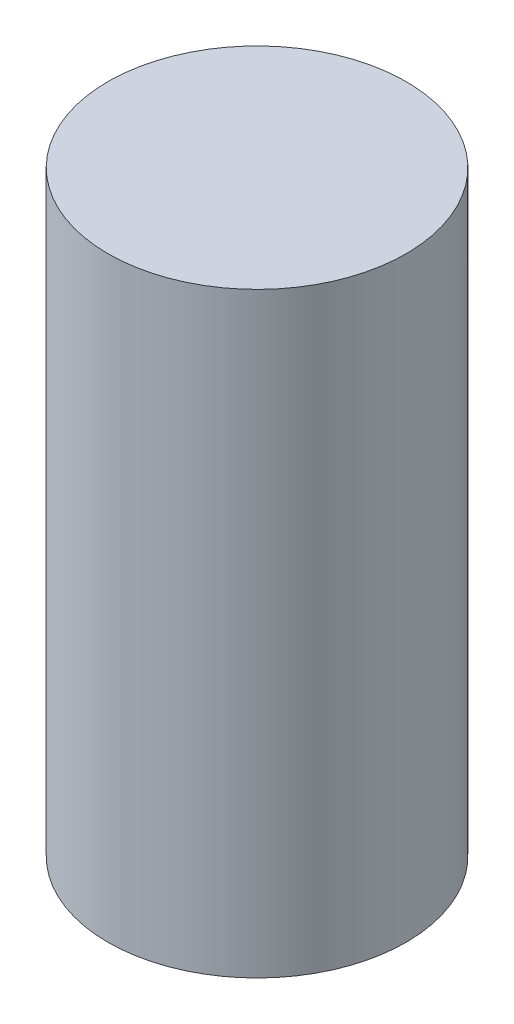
ISO-10303-21;
HEADER;
FILE_DESCRIPTION(('STEP AP214'),'2;1');
FILE_NAME('part.step','',(''),(''),'','','');
FILE_SCHEMA(('AUTOMOTIVE_DESIGN { 1 0 10303 214 1 1 1 1 }'));
ENDSEC;
DATA;
#1=APPLICATION_CONTEXT('core data for automotive mechanical design processes');
#2=APPLICATION_PROTOCOL_DEFINITION('international standard','automotive_design',2000,#1);
#3=PRODUCT_CONTEXT('',#1,'mechanical');
#4=PRODUCT('Part','Part','',(#3));
#5=PRODUCT_RELATED_PRODUCT_CATEGORY('part','',(#4));
#6=PRODUCT_DEFINITION_FORMATION('','',#4);
#7=PRODUCT_DEFINITION_CONTEXT('part definition',#1,'design');
#8=PRODUCT_DEFINITION('design','',#6,#7);
#9=PRODUCT_DEFINITION_SHAPE('','',#8);
#10=(LENGTH_UNIT() NAMED_UNIT(*) SI_UNIT(.MILLI.,.METRE.));
#11=(NAMED_UNIT(*) PLANE_ANGLE_UNIT() SI_UNIT($,.RADIAN.));
#12=(NAMED_UNIT(*) SI_UNIT($,.STERADIAN.) SOLID_ANGLE_UNIT());
#13=UNCERTAINTY_MEASURE_WITH_UNIT(LENGTH_MEASURE(1.E-05),#10,'distance_accuracy_value','');
#14=(GEOMETRIC_REPRESENTATION_CONTEXT(3) GLOBAL_UNCERTAINTY_ASSIGNED_CONTEXT((#13)) GLOBAL_UNIT_ASSIGNED_CONTEXT((#10,
#11,#12)) REPRESENTATION_CONTEXT('',''));
#15=CARTESIAN_POINT('',(0.,0.,0.));
#16=DIRECTION('',(0.,0.,1.));
#17=DIRECTION('',(1.,0.,0.));
#18=AXIS2_PLACEMENT_3D('',#15,#16,#17);
#19=CARTESIAN_POINT('',(0.,25.,0.));
#20=DIRECTION('',(0.,-1.,0.));
#21=DIRECTION('',(0.,0.,-1.));
#22=AXIS2_PLACEMENT_3D('',#19,#20,#21);
#23=CYLINDRICAL_SURFACE('',#22,6.25);
#24=CARTESIAN_POINT('',(0.,25.,0.));
#25=DIRECTION('',(0.,1.,0.));
#26=DIRECTION('',(0.,0.,1.));
#27=AXIS2_PLACEMENT_3D('',#24,#25,#26);
#28=CIRCLE('',#27,6.25);
#29=CARTESIAN_POINT('',(0.,25.,6.25));
#30=VERTEX_POINT('',#29);
#31=EDGE_CURVE('E10',#30,#30,#28,.T.);
#32=ORIENTED_EDGE('',*,*,#31,.F.);
#33=EDGE_LOOP('',(#32));
#34=FACE_BOUND('',#33,.T.);
#35=CARTESIAN_POINT('',(0.,0.,0.));
#36=DIRECTION('',(0.,1.,0.));
#37=DIRECTION('',(0.,0.,1.));
#38=AXIS2_PLACEMENT_3D('',#35,#36,#37);
#39=CIRCLE('',#38,6.25);
#40=CARTESIAN_POINT('',(0.,0.,6.25));
#41=VERTEX_POINT('',#40);
#42=EDGE_CURVE('E32',#41,#41,#39,.T.);
#43=ORIENTED_EDGE('',*,*,#42,.T.);
#44=EDGE_LOOP('',(#43));
#45=FACE_BOUND('',#44,.T.);
#46=ADVANCED_FACE('F29',(#34,#45),#23,.T.);
#47=CARTESIAN_POINT('',(0.,25.,0.));
#48=DIRECTION('',(0.,1.,0.));
#49=DIRECTION('',(0.,0.,1.));
#50=AXIS2_PLACEMENT_3D('',#47,#48,#49);
#51=PLANE('',#50);
#52=ORIENTED_EDGE('',*,*,#31,.T.);
#53=EDGE_LOOP('',(#52));
#54=FACE_BOUND('',#53,.T.);
#55=ADVANCED_FACE('F44',(#54),#51,.T.);
#56=CARTESIAN_POINT('',(0.,0.,0.));
#57=DIRECTION('',(0.,1.,0.));
#58=DIRECTION('',(0.,0.,1.));
#59=AXIS2_PLACEMENT_3D('',#56,#57,#58);
#60=PLANE('',#59);
#61=ORIENTED_EDGE('',*,*,#42,.F.);
#62=EDGE_LOOP('',(#61));
#63=FACE_BOUND('',#62,.T.);
#64=ADVANCED_FACE('F42',(#63),#60,.F.);
#65=CLOSED_SHELL('',(#46,#55,#64));
#66=MANIFOLD_SOLID_BREP('B2',#65);
#67=ADVANCED_BREP_SHAPE_REPRESENTATION('',(#18,#66),#14);
#68=SHAPE_DEFINITION_REPRESENTATION(#9,#67);
ENDSEC;
END-ISO-10303-21;
